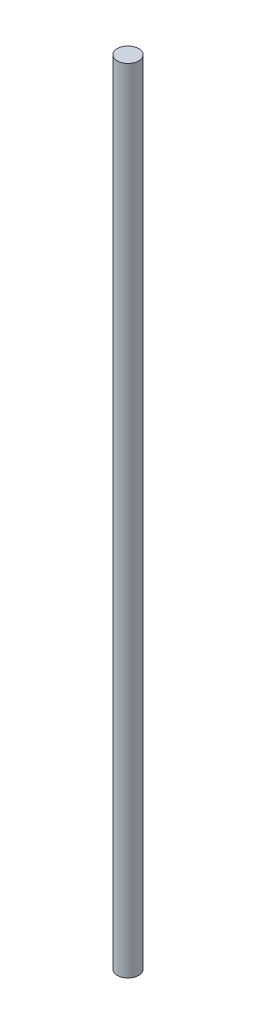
ISO-10303-21;
HEADER;
FILE_DESCRIPTION(('STEP AP214'),'2;1');
FILE_NAME('part.step','',(''),(''),'','','');
FILE_SCHEMA(('AUTOMOTIVE_DESIGN { 1 0 10303 214 1 1 1 1 }'));
ENDSEC;
DATA;
#1=APPLICATION_CONTEXT('core data for automotive mechanical design processes');
#2=APPLICATION_PROTOCOL_DEFINITION('international standard','automotive_design',2000,#1);
#3=PRODUCT_CONTEXT('',#1,'mechanical');
#4=PRODUCT('Part','Part','',(#3));
#5=PRODUCT_RELATED_PRODUCT_CATEGORY('part','',(#4));
#6=PRODUCT_DEFINITION_FORMATION('','',#4);
#7=PRODUCT_DEFINITION_CONTEXT('part definition',#1,'design');
#8=PRODUCT_DEFINITION('design','',#6,#7);
#9=PRODUCT_DEFINITION_SHAPE('','',#8);
#10=(LENGTH_UNIT() NAMED_UNIT(*) SI_UNIT(.MILLI.,.METRE.));
#11=(NAMED_UNIT(*) PLANE_ANGLE_UNIT() SI_UNIT($,.RADIAN.));
#12=(NAMED_UNIT(*) SI_UNIT($,.STERADIAN.) SOLID_ANGLE_UNIT());
#13=UNCERTAINTY_MEASURE_WITH_UNIT(LENGTH_MEASURE(1.E-05),#10,'distance_accuracy_value','');
#14=(GEOMETRIC_REPRESENTATION_CONTEXT(3) GLOBAL_UNCERTAINTY_ASSIGNED_CONTEXT((#13)) GLOBAL_UNIT_ASSIGNED_CONTEXT((#10,
#11,#12)) REPRESENTATION_CONTEXT('',''));
#15=CARTESIAN_POINT('',(0.,0.,0.));
#16=DIRECTION('',(0.,0.,1.));
#17=DIRECTION('',(1.,0.,0.));
#18=AXIS2_PLACEMENT_3D('',#15,#16,#17);
#19=CARTESIAN_POINT('',(0.,240.,0.));
#20=DIRECTION('',(0.,-1.,0.));
#21=DIRECTION('',(0.,0.,-1.));
#22=AXIS2_PLACEMENT_3D('',#19,#20,#21);
#23=CYLINDRICAL_SURFACE('',#22,3.25);
#24=CARTESIAN_POINT('',(0.,240.,0.));
#25=DIRECTION('',(0.,1.,0.));
#26=DIRECTION('',(0.,0.,1.));
#27=AXIS2_PLACEMENT_3D('',#24,#25,#26);
#28=CIRCLE('',#27,3.25);
#29=CARTESIAN_POINT('',(0.,240.,3.25));
#30=VERTEX_POINT('',#29);
#31=EDGE_CURVE('E10',#30,#30,#28,.T.);
#32=ORIENTED_EDGE('',*,*,#31,.F.);
#33=EDGE_LOOP('',(#32));
#34=FACE_BOUND('',#33,.T.);
#35=CARTESIAN_POINT('',(0.,0.,0.));
#36=DIRECTION('',(0.,1.,0.));
#37=DIRECTION('',(0.,0.,1.));
#38=AXIS2_PLACEMENT_3D('',#35,#36,#37);
#39=CIRCLE('',#38,3.25);
#40=CARTESIAN_POINT('',(0.,0.,3.25));
#41=VERTEX_POINT('',#40);
#42=EDGE_CURVE('E30',#41,#41,#39,.T.);
#43=ORIENTED_EDGE('',*,*,#42,.T.);
#44=EDGE_LOOP('',(#43));
#45=FACE_BOUND('',#44,.T.);
#46=ADVANCED_FACE('F24',(#34,#45),#23,.T.);
#47=CARTESIAN_POINT('',(0.,240.,0.));
#48=DIRECTION('',(0.,1.,0.));
#49=DIRECTION('',(0.,0.,1.));
#50=AXIS2_PLACEMENT_3D('',#47,#48,#49);
#51=PLANE('',#50);
#52=ORIENTED_EDGE('',*,*,#31,.T.);
#53=EDGE_LOOP('',(#52));
#54=FACE_BOUND('',#53,.T.);
#55=ADVANCED_FACE('F39',(#54),#51,.T.);
#56=CARTESIAN_POINT('',(0.,0.,0.));
#57=DIRECTION('',(0.,1.,0.));
#58=DIRECTION('',(0.,0.,1.));
#59=AXIS2_PLACEMENT_3D('',#56,#57,#58);
#60=PLANE('',#59);
#61=ORIENTED_EDGE('',*,*,#42,.F.);
#62=EDGE_LOOP('',(#61));
#63=FACE_BOUND('',#62,.T.);
#64=ADVANCED_FACE('F37',(#63),#60,.F.);
#65=CLOSED_SHELL('',(#46,#55,#64));
#66=MANIFOLD_SOLID_BREP('B2',#65);
#67=ADVANCED_BREP_SHAPE_REPRESENTATION('',(#18,#66),#14);
#68=SHAPE_DEFINITION_REPRESENTATION(#9,#67);
ENDSEC;
END-ISO-10303-21;
